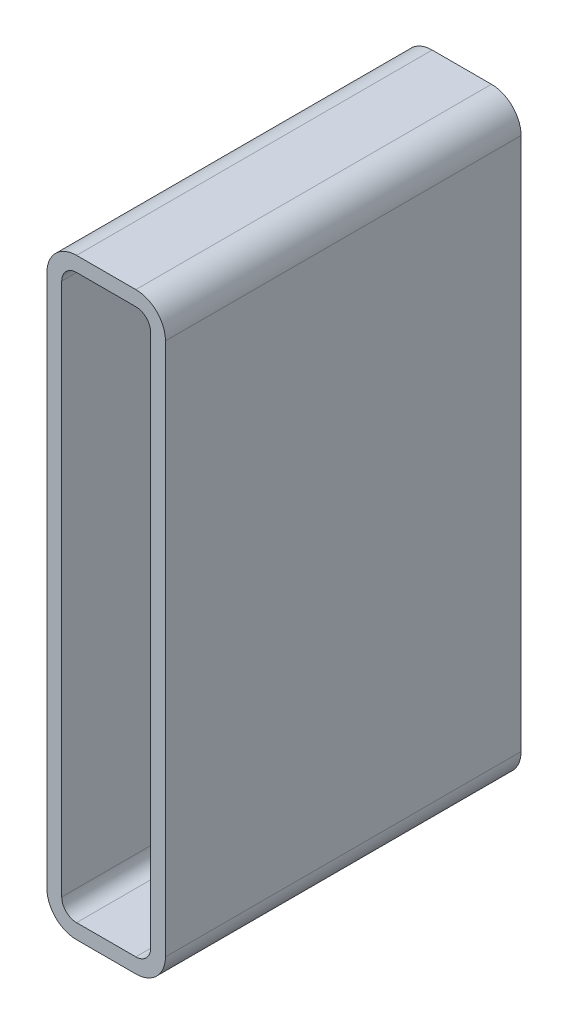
ISO-10303-21;
HEADER;
FILE_DESCRIPTION(('STEP AP214'),'2;1');
FILE_NAME('part.step','',(''),(''),'','','');
FILE_SCHEMA(('AUTOMOTIVE_DESIGN { 1 0 10303 214 1 1 1 1 }'));
ENDSEC;
DATA;
#1=APPLICATION_CONTEXT('core data for automotive mechanical design processes');
#2=APPLICATION_PROTOCOL_DEFINITION('international standard','automotive_design',2000,#1);
#3=PRODUCT_CONTEXT('',#1,'mechanical');
#4=PRODUCT('Part','Part','',(#3));
#5=PRODUCT_RELATED_PRODUCT_CATEGORY('part','',(#4));
#6=PRODUCT_DEFINITION_FORMATION('','',#4);
#7=PRODUCT_DEFINITION_CONTEXT('part definition',#1,'design');
#8=PRODUCT_DEFINITION('design','',#6,#7);
#9=PRODUCT_DEFINITION_SHAPE('','',#8);
#10=(LENGTH_UNIT() NAMED_UNIT(*) SI_UNIT(.MILLI.,.METRE.));
#11=(NAMED_UNIT(*) PLANE_ANGLE_UNIT() SI_UNIT($,.RADIAN.));
#12=(NAMED_UNIT(*) SI_UNIT($,.STERADIAN.) SOLID_ANGLE_UNIT());
#13=UNCERTAINTY_MEASURE_WITH_UNIT(LENGTH_MEASURE(1.E-05),#10,'distance_accuracy_value','');
#14=(GEOMETRIC_REPRESENTATION_CONTEXT(3) GLOBAL_UNCERTAINTY_ASSIGNED_CONTEXT((#13)) GLOBAL_UNIT_ASSIGNED_CONTEXT((#10,
#11,#12)) REPRESENTATION_CONTEXT('',''));
#15=CARTESIAN_POINT('',(0.,0.,0.));
#16=DIRECTION('',(0.,0.,1.));
#17=DIRECTION('',(1.,0.,0.));
#18=AXIS2_PLACEMENT_3D('',#15,#16,#17);
#19=CARTESIAN_POINT('',(77.8751778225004,27.0912282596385,304.8));
#20=DIRECTION('',(0.,0.,1.));
#21=DIRECTION('',(1.,0.,0.));
#22=AXIS2_PLACEMENT_3D('',#19,#20,#21);
#23=PLANE('',#22);
#24=CARTESIAN_POINT('',(77.8751778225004,27.0912282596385,304.8));
#25=DIRECTION('',(0.,0.,1.));
#26=DIRECTION('',(1.,0.,0.));
#27=AXIS2_PLACEMENT_3D('',#24,#25,#26);
#28=CIRCLE('',#27,25.4);
#29=CARTESIAN_POINT('',(77.8751778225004,1.6912282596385,304.8));
#30=VERTEX_POINT('',#29);
#31=CARTESIAN_POINT('',(103.2751778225,27.0912282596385,304.8));
#32=VERTEX_POINT('',#31);
#33=EDGE_CURVE('E211',#30,#32,#28,.T.);
#34=ORIENTED_EDGE('',*,*,#33,.T.);
#35=DIRECTION('',(0.,1.,0.));
#36=VECTOR('',#35,1.);
#37=CARTESIAN_POINT('',(103.2751778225,27.0912282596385,304.8));
#38=LINE('',#37,#36);
#39=CARTESIAN_POINT('',(103.2751778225,484.291228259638,304.8));
#40=VERTEX_POINT('',#39);
#41=EDGE_CURVE('E214',#32,#40,#38,.T.);
#42=ORIENTED_EDGE('',*,*,#41,.T.);
#43=CARTESIAN_POINT('',(77.8751778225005,484.291228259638,304.8));
#44=DIRECTION('',(0.,0.,1.));
#45=DIRECTION('',(1.,0.,0.));
#46=AXIS2_PLACEMENT_3D('',#43,#44,#45);
#47=CIRCLE('',#46,25.4);
#48=CARTESIAN_POINT('',(77.8751778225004,509.691228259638,304.8));
#49=VERTEX_POINT('',#48);
#50=EDGE_CURVE('E217',#40,#49,#47,.T.);
#51=ORIENTED_EDGE('',*,*,#50,.T.);
#52=DIRECTION('',(-1.,0.,0.));
#53=VECTOR('',#52,1.);
#54=CARTESIAN_POINT('',(77.8751778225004,509.691228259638,304.8));
#55=LINE('',#54,#53);
#56=CARTESIAN_POINT('',(27.0751778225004,509.691228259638,304.8));
#57=VERTEX_POINT('',#56);
#58=EDGE_CURVE('E219',#49,#57,#55,.T.);
#59=ORIENTED_EDGE('',*,*,#58,.T.);
#60=CARTESIAN_POINT('',(27.0751778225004,484.291228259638,304.8));
#61=DIRECTION('',(0.,0.,1.));
#62=DIRECTION('',(1.,0.,0.));
#63=AXIS2_PLACEMENT_3D('',#60,#61,#62);
#64=CIRCLE('',#63,25.4);
#65=CARTESIAN_POINT('',(1.67517782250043,484.291228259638,304.8));
#66=VERTEX_POINT('',#65);
#67=EDGE_CURVE('E221',#57,#66,#64,.T.);
#68=ORIENTED_EDGE('',*,*,#67,.T.);
#69=DIRECTION('',(0.,-1.,0.));
#70=VECTOR('',#69,1.);
#71=CARTESIAN_POINT('',(1.67517782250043,484.291228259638,304.8));
#72=LINE('',#71,#70);
#73=CARTESIAN_POINT('',(1.67517782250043,27.0912282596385,304.8));
#74=VERTEX_POINT('',#73);
#75=EDGE_CURVE('E223',#66,#74,#72,.T.);
#76=ORIENTED_EDGE('',*,*,#75,.T.);
#77=CARTESIAN_POINT('',(27.0751778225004,27.0912282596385,304.8));
#78=DIRECTION('',(0.,0.,1.));
#79=DIRECTION('',(1.,0.,0.));
#80=AXIS2_PLACEMENT_3D('',#77,#78,#79);
#81=CIRCLE('',#80,25.4);
#82=CARTESIAN_POINT('',(27.0751778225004,1.6912282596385,304.8));
#83=VERTEX_POINT('',#82);
#84=EDGE_CURVE('E225',#74,#83,#81,.T.);
#85=ORIENTED_EDGE('',*,*,#84,.T.);
#86=DIRECTION('',(1.,0.,0.));
#87=VECTOR('',#86,1.);
#88=CARTESIAN_POINT('',(27.0751778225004,1.6912282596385,304.8));
#89=LINE('',#88,#87);
#90=EDGE_CURVE('E227',#83,#30,#89,.T.);
#91=ORIENTED_EDGE('',*,*,#90,.T.);
#92=EDGE_LOOP('',(#34,#42,#51,#59,#68,#76,#85,#91));
#93=FACE_BOUND('',#92,.T.);
#94=DIRECTION('',(0.,-1.,0.));
#95=VECTOR('',#94,1.);
#96=CARTESIAN_POINT('',(14.3751778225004,27.0912282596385,304.8));
#97=LINE('',#96,#95);
#98=CARTESIAN_POINT('',(14.3751778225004,484.291228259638,304.8));
#99=VERTEX_POINT('',#98);
#100=CARTESIAN_POINT('',(14.3751778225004,27.0912282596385,304.8));
#101=VERTEX_POINT('',#100);
#102=EDGE_CURVE('E154',#99,#101,#97,.T.);
#103=ORIENTED_EDGE('',*,*,#102,.F.);
#104=CARTESIAN_POINT('',(27.0751778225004,484.291228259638,304.8));
#105=DIRECTION('',(0.,0.,1.));
#106=DIRECTION('',(1.,0.,0.));
#107=AXIS2_PLACEMENT_3D('',#104,#105,#106);
#108=CIRCLE('',#107,12.7);
#109=CARTESIAN_POINT('',(27.0751778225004,496.991228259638,304.8));
#110=VERTEX_POINT('',#109);
#111=EDGE_CURVE('E146',#110,#99,#108,.T.);
#112=ORIENTED_EDGE('',*,*,#111,.F.);
#113=DIRECTION('',(-1.,0.,0.));
#114=VECTOR('',#113,1.);
#115=CARTESIAN_POINT('',(27.0751778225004,496.991228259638,304.8));
#116=LINE('',#115,#114);
#117=CARTESIAN_POINT('',(77.8751778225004,496.991228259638,304.8));
#118=VERTEX_POINT('',#117);
#119=EDGE_CURVE('E179',#118,#110,#116,.T.);
#120=ORIENTED_EDGE('',*,*,#119,.F.);
#121=CARTESIAN_POINT('',(77.8751778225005,484.291228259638,304.8));
#122=DIRECTION('',(0.,0.,1.));
#123=DIRECTION('',(1.,0.,0.));
#124=AXIS2_PLACEMENT_3D('',#121,#122,#123);
#125=CIRCLE('',#124,12.7);
#126=CARTESIAN_POINT('',(90.5751778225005,484.291228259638,304.8));
#127=VERTEX_POINT('',#126);
#128=EDGE_CURVE('E177',#127,#118,#125,.T.);
#129=ORIENTED_EDGE('',*,*,#128,.F.);
#130=DIRECTION('',(0.,1.,0.));
#131=VECTOR('',#130,1.);
#132=CARTESIAN_POINT('',(90.5751778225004,484.291228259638,304.8));
#133=LINE('',#132,#131);
#134=CARTESIAN_POINT('',(90.5751778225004,27.0912282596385,304.8));
#135=VERTEX_POINT('',#134);
#136=EDGE_CURVE('E175',#135,#127,#133,.T.);
#137=ORIENTED_EDGE('',*,*,#136,.F.);
#138=CARTESIAN_POINT('',(77.8751778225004,27.0912282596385,304.8));
#139=DIRECTION('',(0.,0.,1.));
#140=DIRECTION('',(1.,0.,0.));
#141=AXIS2_PLACEMENT_3D('',#138,#139,#140);
#142=CIRCLE('',#141,12.7);
#143=CARTESIAN_POINT('',(77.8751778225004,14.3912282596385,304.8));
#144=VERTEX_POINT('',#143);
#145=EDGE_CURVE('E173',#144,#135,#142,.T.);
#146=ORIENTED_EDGE('',*,*,#145,.F.);
#147=DIRECTION('',(1.,0.,0.));
#148=VECTOR('',#147,1.);
#149=CARTESIAN_POINT('',(77.8751778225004,14.3912282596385,304.8));
#150=LINE('',#149,#148);
#151=CARTESIAN_POINT('',(27.0751778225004,14.3912282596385,304.8));
#152=VERTEX_POINT('',#151);
#153=EDGE_CURVE('E169',#152,#144,#150,.T.);
#154=ORIENTED_EDGE('',*,*,#153,.F.);
#155=CARTESIAN_POINT('',(27.0751778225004,27.0912282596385,304.8));
#156=DIRECTION('',(0.,0.,1.));
#157=DIRECTION('',(1.,0.,0.));
#158=AXIS2_PLACEMENT_3D('',#155,#156,#157);
#159=CIRCLE('',#158,12.7);
#160=EDGE_CURVE('E167',#101,#152,#159,.T.);
#161=ORIENTED_EDGE('',*,*,#160,.F.);
#162=EDGE_LOOP('',(#103,#112,#120,#129,#137,#146,#154,#161));
#163=FACE_BOUND('',#162,.T.);
#164=ADVANCED_FACE('F33',(#93,#163),#23,.T.);
#165=CARTESIAN_POINT('',(77.8751778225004,27.0912282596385,0.));
#166=DIRECTION('',(0.,0.,1.));
#167=DIRECTION('',(1.,0.,0.));
#168=AXIS2_PLACEMENT_3D('',#165,#166,#167);
#169=PLANE('',#168);
#170=CARTESIAN_POINT('',(77.8751778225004,27.0912282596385,0.));
#171=DIRECTION('',(0.,0.,1.));
#172=DIRECTION('',(1.,0.,0.));
#173=AXIS2_PLACEMENT_3D('',#170,#171,#172);
#174=CIRCLE('',#173,25.4);
#175=CARTESIAN_POINT('',(77.8751778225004,1.6912282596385,0.));
#176=VERTEX_POINT('',#175);
#177=CARTESIAN_POINT('',(103.2751778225,27.0912282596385,0.));
#178=VERTEX_POINT('',#177);
#179=EDGE_CURVE('E162',#176,#178,#174,.T.);
#180=ORIENTED_EDGE('',*,*,#179,.F.);
#181=DIRECTION('',(1.,0.,0.));
#182=VECTOR('',#181,1.);
#183=CARTESIAN_POINT('',(27.0751778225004,1.6912282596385,0.));
#184=LINE('',#183,#182);
#185=CARTESIAN_POINT('',(27.0751778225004,1.6912282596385,0.));
#186=VERTEX_POINT('',#185);
#187=EDGE_CURVE('E215',#186,#176,#184,.T.);
#188=ORIENTED_EDGE('',*,*,#187,.F.);
#189=CARTESIAN_POINT('',(27.0751778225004,27.0912282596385,0.));
#190=DIRECTION('',(0.,0.,1.));
#191=DIRECTION('',(1.,0.,0.));
#192=AXIS2_PLACEMENT_3D('',#189,#190,#191);
#193=CIRCLE('',#192,25.4);
#194=CARTESIAN_POINT('',(1.67517782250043,27.0912282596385,0.));
#195=VERTEX_POINT('',#194);
#196=EDGE_CURVE('E242',#195,#186,#193,.T.);
#197=ORIENTED_EDGE('',*,*,#196,.F.);
#198=DIRECTION('',(0.,-1.,0.));
#199=VECTOR('',#198,1.);
#200=CARTESIAN_POINT('',(1.67517782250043,484.291228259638,0.));
#201=LINE('',#200,#199);
#202=CARTESIAN_POINT('',(1.67517782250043,484.291228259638,0.));
#203=VERTEX_POINT('',#202);
#204=EDGE_CURVE('E240',#203,#195,#201,.T.);
#205=ORIENTED_EDGE('',*,*,#204,.F.);
#206=CARTESIAN_POINT('',(27.0751778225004,484.291228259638,0.));
#207=DIRECTION('',(0.,0.,1.));
#208=DIRECTION('',(1.,0.,0.));
#209=AXIS2_PLACEMENT_3D('',#206,#207,#208);
#210=CIRCLE('',#209,25.4);
#211=CARTESIAN_POINT('',(27.0751778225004,509.691228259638,0.));
#212=VERTEX_POINT('',#211);
#213=EDGE_CURVE('E238',#212,#203,#210,.T.);
#214=ORIENTED_EDGE('',*,*,#213,.F.);
#215=DIRECTION('',(-1.,0.,0.));
#216=VECTOR('',#215,1.);
#217=CARTESIAN_POINT('',(77.8751778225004,509.691228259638,0.));
#218=LINE('',#217,#216);
#219=CARTESIAN_POINT('',(77.8751778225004,509.691228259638,0.));
#220=VERTEX_POINT('',#219);
#221=EDGE_CURVE('E236',#220,#212,#218,.T.);
#222=ORIENTED_EDGE('',*,*,#221,.F.);
#223=CARTESIAN_POINT('',(77.8751778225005,484.291228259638,0.));
#224=DIRECTION('',(0.,0.,1.));
#225=DIRECTION('',(1.,0.,0.));
#226=AXIS2_PLACEMENT_3D('',#223,#224,#225);
#227=CIRCLE('',#226,25.4);
#228=CARTESIAN_POINT('',(103.2751778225,484.291228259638,0.));
#229=VERTEX_POINT('',#228);
#230=EDGE_CURVE('E234',#229,#220,#227,.T.);
#231=ORIENTED_EDGE('',*,*,#230,.F.);
#232=DIRECTION('',(0.,1.,0.));
#233=VECTOR('',#232,1.);
#234=CARTESIAN_POINT('',(103.2751778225,27.0912282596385,0.));
#235=LINE('',#234,#233);
#236=EDGE_CURVE('E232',#178,#229,#235,.T.);
#237=ORIENTED_EDGE('',*,*,#236,.F.);
#238=EDGE_LOOP('',(#180,#188,#197,#205,#214,#222,#231,#237));
#239=FACE_BOUND('',#238,.T.);
#240=CARTESIAN_POINT('',(27.0751778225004,484.291228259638,0.));
#241=DIRECTION('',(0.,0.,1.));
#242=DIRECTION('',(1.,0.,0.));
#243=AXIS2_PLACEMENT_3D('',#240,#241,#242);
#244=CIRCLE('',#243,12.7);
#245=CARTESIAN_POINT('',(27.0751778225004,496.991228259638,0.));
#246=VERTEX_POINT('',#245);
#247=CARTESIAN_POINT('',(14.3751778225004,484.291228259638,0.));
#248=VERTEX_POINT('',#247);
#249=EDGE_CURVE('E56',#246,#248,#244,.T.);
#250=ORIENTED_EDGE('',*,*,#249,.T.);
#251=DIRECTION('',(0.,-1.,0.));
#252=VECTOR('',#251,1.);
#253=CARTESIAN_POINT('',(14.3751778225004,27.0912282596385,0.));
#254=LINE('',#253,#252);
#255=CARTESIAN_POINT('',(14.3751778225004,27.0912282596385,0.));
#256=VERTEX_POINT('',#255);
#257=EDGE_CURVE('E161',#248,#256,#254,.T.);
#258=ORIENTED_EDGE('',*,*,#257,.T.);
#259=CARTESIAN_POINT('',(27.0751778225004,27.0912282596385,0.));
#260=DIRECTION('',(0.,0.,1.));
#261=DIRECTION('',(1.,0.,0.));
#262=AXIS2_PLACEMENT_3D('',#259,#260,#261);
#263=CIRCLE('',#262,12.7);
#264=CARTESIAN_POINT('',(27.0751778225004,14.3912282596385,0.));
#265=VERTEX_POINT('',#264);
#266=EDGE_CURVE('E183',#256,#265,#263,.T.);
#267=ORIENTED_EDGE('',*,*,#266,.T.);
#268=DIRECTION('',(1.,0.,0.));
#269=VECTOR('',#268,1.);
#270=CARTESIAN_POINT('',(77.8751778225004,14.3912282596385,0.));
#271=LINE('',#270,#269);
#272=CARTESIAN_POINT('',(77.8751778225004,14.3912282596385,0.));
#273=VERTEX_POINT('',#272);
#274=EDGE_CURVE('E186',#265,#273,#271,.T.);
#275=ORIENTED_EDGE('',*,*,#274,.T.);
#276=CARTESIAN_POINT('',(77.8751778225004,27.0912282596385,0.));
#277=DIRECTION('',(0.,0.,1.));
#278=DIRECTION('',(1.,0.,0.));
#279=AXIS2_PLACEMENT_3D('',#276,#277,#278);
#280=CIRCLE('',#279,12.7);
#281=CARTESIAN_POINT('',(90.5751778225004,27.0912282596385,0.));
#282=VERTEX_POINT('',#281);
#283=EDGE_CURVE('E189',#273,#282,#280,.T.);
#284=ORIENTED_EDGE('',*,*,#283,.T.);
#285=DIRECTION('',(0.,1.,0.));
#286=VECTOR('',#285,1.);
#287=CARTESIAN_POINT('',(90.5751778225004,484.291228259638,0.));
#288=LINE('',#287,#286);
#289=CARTESIAN_POINT('',(90.5751778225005,484.291228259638,0.));
#290=VERTEX_POINT('',#289);
#291=EDGE_CURVE('E192',#282,#290,#288,.T.);
#292=ORIENTED_EDGE('',*,*,#291,.T.);
#293=CARTESIAN_POINT('',(77.8751778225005,484.291228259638,0.));
#294=DIRECTION('',(0.,0.,1.));
#295=DIRECTION('',(1.,0.,0.));
#296=AXIS2_PLACEMENT_3D('',#293,#294,#295);
#297=CIRCLE('',#296,12.7);
#298=CARTESIAN_POINT('',(77.8751778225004,496.991228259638,0.));
#299=VERTEX_POINT('',#298);
#300=EDGE_CURVE('E195',#290,#299,#297,.T.);
#301=ORIENTED_EDGE('',*,*,#300,.T.);
#302=DIRECTION('',(-1.,0.,0.));
#303=VECTOR('',#302,1.);
#304=CARTESIAN_POINT('',(27.0751778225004,496.991228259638,0.));
#305=LINE('',#304,#303);
#306=EDGE_CURVE('E155',#299,#246,#305,.T.);
#307=ORIENTED_EDGE('',*,*,#306,.T.);
#308=EDGE_LOOP('',(#250,#258,#267,#275,#284,#292,#301,#307));
#309=FACE_BOUND('',#308,.T.);
#310=ADVANCED_FACE('F272',(#239,#309),#169,.F.);
#311=CARTESIAN_POINT('',(77.8751778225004,27.0912282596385,304.8));
#312=DIRECTION('',(0.,0.,-1.));
#313=DIRECTION('',(-1.,0.,0.));
#314=AXIS2_PLACEMENT_3D('',#311,#312,#313);
#315=CYLINDRICAL_SURFACE('',#314,25.4);
#316=ORIENTED_EDGE('',*,*,#179,.T.);
#317=DIRECTION('',(0.,0.,-1.));
#318=VECTOR('',#317,1.);
#319=CARTESIAN_POINT('',(103.2751778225,27.0912282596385,304.8));
#320=LINE('',#319,#318);
#321=EDGE_CURVE('E11',#32,#178,#320,.T.);
#322=ORIENTED_EDGE('',*,*,#321,.F.);
#323=ORIENTED_EDGE('',*,*,#33,.F.);
#324=DIRECTION('',(0.,0.,-1.));
#325=VECTOR('',#324,1.);
#326=CARTESIAN_POINT('',(77.8751778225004,1.6912282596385,304.8));
#327=LINE('',#326,#325);
#328=EDGE_CURVE('E229',#30,#176,#327,.T.);
#329=ORIENTED_EDGE('',*,*,#328,.T.);
#330=EDGE_LOOP('',(#316,#322,#323,#329));
#331=FACE_BOUND('',#330,.T.);
#332=ADVANCED_FACE('F35',(#331),#315,.T.);
#333=CARTESIAN_POINT('',(103.2751778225,27.0912282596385,304.8));
#334=DIRECTION('',(-1.,0.,0.));
#335=DIRECTION('',(0.,0.,1.));
#336=AXIS2_PLACEMENT_3D('',#333,#334,#335);
#337=PLANE('',#336);
#338=ORIENTED_EDGE('',*,*,#236,.T.);
#339=DIRECTION('',(0.,0.,-1.));
#340=VECTOR('',#339,1.);
#341=CARTESIAN_POINT('',(103.2751778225,484.291228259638,304.8));
#342=LINE('',#341,#340);
#343=EDGE_CURVE('E41',#40,#229,#342,.T.);
#344=ORIENTED_EDGE('',*,*,#343,.F.);
#345=ORIENTED_EDGE('',*,*,#41,.F.);
#346=ORIENTED_EDGE('',*,*,#321,.T.);
#347=EDGE_LOOP('',(#338,#344,#345,#346));
#348=FACE_BOUND('',#347,.T.);
#349=ADVANCED_FACE('F289',(#348),#337,.F.);
#350=CARTESIAN_POINT('',(77.8751778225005,484.291228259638,304.8));
#351=DIRECTION('',(0.,0.,-1.));
#352=DIRECTION('',(-1.,0.,0.));
#353=AXIS2_PLACEMENT_3D('',#350,#351,#352);
#354=CYLINDRICAL_SURFACE('',#353,25.4);
#355=ORIENTED_EDGE('',*,*,#230,.T.);
#356=DIRECTION('',(0.,0.,-1.));
#357=VECTOR('',#356,1.);
#358=CARTESIAN_POINT('',(77.8751778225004,509.691228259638,304.8));
#359=LINE('',#358,#357);
#360=EDGE_CURVE('E259',#49,#220,#359,.T.);
#361=ORIENTED_EDGE('',*,*,#360,.F.);
#362=ORIENTED_EDGE('',*,*,#50,.F.);
#363=ORIENTED_EDGE('',*,*,#343,.T.);
#364=EDGE_LOOP('',(#355,#361,#362,#363));
#365=FACE_BOUND('',#364,.T.);
#366=ADVANCED_FACE('F266',(#365),#354,.T.);
#367=CARTESIAN_POINT('',(77.8751778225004,509.691228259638,304.8));
#368=DIRECTION('',(0.,-1.,0.));
#369=DIRECTION('',(0.,0.,-1.));
#370=AXIS2_PLACEMENT_3D('',#367,#368,#369);
#371=PLANE('',#370);
#372=ORIENTED_EDGE('',*,*,#221,.T.);
#373=DIRECTION('',(0.,0.,-1.));
#374=VECTOR('',#373,1.);
#375=CARTESIAN_POINT('',(27.0751778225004,509.691228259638,304.8));
#376=LINE('',#375,#374);
#377=EDGE_CURVE('E256',#57,#212,#376,.T.);
#378=ORIENTED_EDGE('',*,*,#377,.F.);
#379=ORIENTED_EDGE('',*,*,#58,.F.);
#380=ORIENTED_EDGE('',*,*,#360,.T.);
#381=EDGE_LOOP('',(#372,#378,#379,#380));
#382=FACE_BOUND('',#381,.T.);
#383=ADVANCED_FACE('F278',(#382),#371,.F.);
#384=CARTESIAN_POINT('',(27.0751778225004,484.291228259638,304.8));
#385=DIRECTION('',(0.,0.,-1.));
#386=DIRECTION('',(-1.,0.,0.));
#387=AXIS2_PLACEMENT_3D('',#384,#385,#386);
#388=CYLINDRICAL_SURFACE('',#387,25.4);
#389=ORIENTED_EDGE('',*,*,#213,.T.);
#390=DIRECTION('',(0.,0.,-1.));
#391=VECTOR('',#390,1.);
#392=CARTESIAN_POINT('',(1.67517782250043,484.291228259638,304.8));
#393=LINE('',#392,#391);
#394=EDGE_CURVE('E253',#66,#203,#393,.T.);
#395=ORIENTED_EDGE('',*,*,#394,.F.);
#396=ORIENTED_EDGE('',*,*,#67,.F.);
#397=ORIENTED_EDGE('',*,*,#377,.T.);
#398=EDGE_LOOP('',(#389,#395,#396,#397));
#399=FACE_BOUND('',#398,.T.);
#400=ADVANCED_FACE('F282',(#399),#388,.T.);
#401=CARTESIAN_POINT('',(1.67517782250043,484.291228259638,304.8));
#402=DIRECTION('',(1.,0.,0.));
#403=DIRECTION('',(0.,0.,-1.));
#404=AXIS2_PLACEMENT_3D('',#401,#402,#403);
#405=PLANE('',#404);
#406=ORIENTED_EDGE('',*,*,#204,.T.);
#407=DIRECTION('',(0.,0.,-1.));
#408=VECTOR('',#407,1.);
#409=CARTESIAN_POINT('',(1.67517782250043,27.0912282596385,304.8));
#410=LINE('',#409,#408);
#411=EDGE_CURVE('E250',#74,#195,#410,.T.);
#412=ORIENTED_EDGE('',*,*,#411,.F.);
#413=ORIENTED_EDGE('',*,*,#75,.F.);
#414=ORIENTED_EDGE('',*,*,#394,.T.);
#415=EDGE_LOOP('',(#406,#412,#413,#414));
#416=FACE_BOUND('',#415,.T.);
#417=ADVANCED_FACE('F302',(#416),#405,.F.);
#418=CARTESIAN_POINT('',(27.0751778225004,27.0912282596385,304.8));
#419=DIRECTION('',(0.,0.,-1.));
#420=DIRECTION('',(-1.,0.,0.));
#421=AXIS2_PLACEMENT_3D('',#418,#419,#420);
#422=CYLINDRICAL_SURFACE('',#421,25.4);
#423=ORIENTED_EDGE('',*,*,#196,.T.);
#424=DIRECTION('',(0.,0.,-1.));
#425=VECTOR('',#424,1.);
#426=CARTESIAN_POINT('',(27.0751778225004,1.6912282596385,304.8));
#427=LINE('',#426,#425);
#428=EDGE_CURVE('E247',#83,#186,#427,.T.);
#429=ORIENTED_EDGE('',*,*,#428,.F.);
#430=ORIENTED_EDGE('',*,*,#84,.F.);
#431=ORIENTED_EDGE('',*,*,#411,.T.);
#432=EDGE_LOOP('',(#423,#429,#430,#431));
#433=FACE_BOUND('',#432,.T.);
#434=ADVANCED_FACE('F300',(#433),#422,.T.);
#435=CARTESIAN_POINT('',(27.0751778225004,1.6912282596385,304.8));
#436=DIRECTION('',(0.,1.,0.));
#437=DIRECTION('',(0.,0.,1.));
#438=AXIS2_PLACEMENT_3D('',#435,#436,#437);
#439=PLANE('',#438);
#440=ORIENTED_EDGE('',*,*,#187,.T.);
#441=ORIENTED_EDGE('',*,*,#328,.F.);
#442=ORIENTED_EDGE('',*,*,#90,.F.);
#443=ORIENTED_EDGE('',*,*,#428,.T.);
#444=EDGE_LOOP('',(#440,#441,#442,#443));
#445=FACE_BOUND('',#444,.T.);
#446=ADVANCED_FACE('F295',(#445),#439,.F.);
#447=CARTESIAN_POINT('',(27.0751778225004,484.291228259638,304.8));
#448=DIRECTION('',(0.,0.,-1.));
#449=DIRECTION('',(-1.,0.,0.));
#450=AXIS2_PLACEMENT_3D('',#447,#448,#449);
#451=CYLINDRICAL_SURFACE('',#450,12.7);
#452=ORIENTED_EDGE('',*,*,#249,.F.);
#453=DIRECTION('',(0.,0.,-1.));
#454=VECTOR('',#453,1.);
#455=CARTESIAN_POINT('',(27.0751778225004,496.991228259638,304.8));
#456=LINE('',#455,#454);
#457=EDGE_CURVE('E150',#110,#246,#456,.T.);
#458=ORIENTED_EDGE('',*,*,#457,.F.);
#459=ORIENTED_EDGE('',*,*,#111,.T.);
#460=DIRECTION('',(0.,0.,-1.));
#461=VECTOR('',#460,1.);
#462=CARTESIAN_POINT('',(14.3751778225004,484.291228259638,304.8));
#463=LINE('',#462,#461);
#464=EDGE_CURVE('E149',#99,#248,#463,.T.);
#465=ORIENTED_EDGE('',*,*,#464,.T.);
#466=EDGE_LOOP('',(#452,#458,#459,#465));
#467=FACE_BOUND('',#466,.T.);
#468=ADVANCED_FACE('F148',(#467),#451,.F.);
#469=CARTESIAN_POINT('',(14.3751778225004,27.0912282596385,304.8));
#470=DIRECTION('',(1.,0.,0.));
#471=DIRECTION('',(0.,0.,-1.));
#472=AXIS2_PLACEMENT_3D('',#469,#470,#471);
#473=PLANE('',#472);
#474=ORIENTED_EDGE('',*,*,#257,.F.);
#475=ORIENTED_EDGE('',*,*,#464,.F.);
#476=ORIENTED_EDGE('',*,*,#102,.T.);
#477=DIRECTION('',(0.,0.,-1.));
#478=VECTOR('',#477,1.);
#479=CARTESIAN_POINT('',(14.3751778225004,27.0912282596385,304.8));
#480=LINE('',#479,#478);
#481=EDGE_CURVE('E163',#101,#256,#480,.T.);
#482=ORIENTED_EDGE('',*,*,#481,.T.);
#483=EDGE_LOOP('',(#474,#475,#476,#482));
#484=FACE_BOUND('',#483,.T.);
#485=ADVANCED_FACE('F158',(#484),#473,.T.);
#486=CARTESIAN_POINT('',(27.0751778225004,27.0912282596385,304.8));
#487=DIRECTION('',(0.,0.,-1.));
#488=DIRECTION('',(-1.,0.,0.));
#489=AXIS2_PLACEMENT_3D('',#486,#487,#488);
#490=CYLINDRICAL_SURFACE('',#489,12.7);
#491=ORIENTED_EDGE('',*,*,#266,.F.);
#492=ORIENTED_EDGE('',*,*,#481,.F.);
#493=ORIENTED_EDGE('',*,*,#160,.T.);
#494=DIRECTION('',(0.,0.,-1.));
#495=VECTOR('',#494,1.);
#496=CARTESIAN_POINT('',(27.0751778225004,14.3912282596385,304.8));
#497=LINE('',#496,#495);
#498=EDGE_CURVE('E208',#152,#265,#497,.T.);
#499=ORIENTED_EDGE('',*,*,#498,.T.);
#500=EDGE_LOOP('',(#491,#492,#493,#499));
#501=FACE_BOUND('',#500,.T.);
#502=ADVANCED_FACE('F327',(#501),#490,.F.);
#503=CARTESIAN_POINT('',(77.8751778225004,14.3912282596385,304.8));
#504=DIRECTION('',(0.,1.,0.));
#505=DIRECTION('',(0.,0.,1.));
#506=AXIS2_PLACEMENT_3D('',#503,#504,#505);
#507=PLANE('',#506);
#508=ORIENTED_EDGE('',*,*,#274,.F.);
#509=ORIENTED_EDGE('',*,*,#498,.F.);
#510=ORIENTED_EDGE('',*,*,#153,.T.);
#511=DIRECTION('',(0.,0.,-1.));
#512=VECTOR('',#511,1.);
#513=CARTESIAN_POINT('',(77.8751778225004,14.3912282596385,304.8));
#514=LINE('',#513,#512);
#515=EDGE_CURVE('E206',#144,#273,#514,.T.);
#516=ORIENTED_EDGE('',*,*,#515,.T.);
#517=EDGE_LOOP('',(#508,#509,#510,#516));
#518=FACE_BOUND('',#517,.T.);
#519=ADVANCED_FACE('F331',(#518),#507,.T.);
#520=CARTESIAN_POINT('',(77.8751778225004,27.0912282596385,304.8));
#521=DIRECTION('',(0.,0.,-1.));
#522=DIRECTION('',(-1.,0.,0.));
#523=AXIS2_PLACEMENT_3D('',#520,#521,#522);
#524=CYLINDRICAL_SURFACE('',#523,12.7);
#525=ORIENTED_EDGE('',*,*,#283,.F.);
#526=ORIENTED_EDGE('',*,*,#515,.F.);
#527=ORIENTED_EDGE('',*,*,#145,.T.);
#528=DIRECTION('',(0.,0.,-1.));
#529=VECTOR('',#528,1.);
#530=CARTESIAN_POINT('',(90.5751778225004,27.0912282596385,304.8));
#531=LINE('',#530,#529);
#532=EDGE_CURVE('E204',#135,#282,#531,.T.);
#533=ORIENTED_EDGE('',*,*,#532,.T.);
#534=EDGE_LOOP('',(#525,#526,#527,#533));
#535=FACE_BOUND('',#534,.T.);
#536=ADVANCED_FACE('F337',(#535),#524,.F.);
#537=CARTESIAN_POINT('',(90.5751778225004,484.291228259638,304.8));
#538=DIRECTION('',(-1.,0.,0.));
#539=DIRECTION('',(0.,0.,1.));
#540=AXIS2_PLACEMENT_3D('',#537,#538,#539);
#541=PLANE('',#540);
#542=ORIENTED_EDGE('',*,*,#291,.F.);
#543=ORIENTED_EDGE('',*,*,#532,.F.);
#544=ORIENTED_EDGE('',*,*,#136,.T.);
#545=DIRECTION('',(0.,0.,-1.));
#546=VECTOR('',#545,1.);
#547=CARTESIAN_POINT('',(90.5751778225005,484.291228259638,304.8));
#548=LINE('',#547,#546);
#549=EDGE_CURVE('E202',#127,#290,#548,.T.);
#550=ORIENTED_EDGE('',*,*,#549,.T.);
#551=EDGE_LOOP('',(#542,#543,#544,#550));
#552=FACE_BOUND('',#551,.T.);
#553=ADVANCED_FACE('F341',(#552),#541,.T.);
#554=CARTESIAN_POINT('',(77.8751778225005,484.291228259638,304.8));
#555=DIRECTION('',(0.,0.,-1.));
#556=DIRECTION('',(-1.,0.,0.));
#557=AXIS2_PLACEMENT_3D('',#554,#555,#556);
#558=CYLINDRICAL_SURFACE('',#557,12.7);
#559=ORIENTED_EDGE('',*,*,#300,.F.);
#560=ORIENTED_EDGE('',*,*,#549,.F.);
#561=ORIENTED_EDGE('',*,*,#128,.T.);
#562=DIRECTION('',(0.,0.,-1.));
#563=VECTOR('',#562,1.);
#564=CARTESIAN_POINT('',(77.8751778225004,496.991228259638,304.8));
#565=LINE('',#564,#563);
#566=EDGE_CURVE('E48',#118,#299,#565,.T.);
#567=ORIENTED_EDGE('',*,*,#566,.T.);
#568=EDGE_LOOP('',(#559,#560,#561,#567));
#569=FACE_BOUND('',#568,.T.);
#570=ADVANCED_FACE('F345',(#569),#558,.F.);
#571=CARTESIAN_POINT('',(27.0751778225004,496.991228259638,304.8));
#572=DIRECTION('',(0.,-1.,0.));
#573=DIRECTION('',(0.,0.,-1.));
#574=AXIS2_PLACEMENT_3D('',#571,#572,#573);
#575=PLANE('',#574);
#576=ORIENTED_EDGE('',*,*,#306,.F.);
#577=ORIENTED_EDGE('',*,*,#566,.F.);
#578=ORIENTED_EDGE('',*,*,#119,.T.);
#579=ORIENTED_EDGE('',*,*,#457,.T.);
#580=EDGE_LOOP('',(#576,#577,#578,#579));
#581=FACE_BOUND('',#580,.T.);
#582=ADVANCED_FACE('F349',(#581),#575,.T.);
#583=CLOSED_SHELL('',(#164,#310,#332,#349,#366,#383,#400,#417,#434,#446,#468,#485,#502,#519,
#536,#553,#570,#582));
#584=MANIFOLD_SOLID_BREP('B2',#583);
#585=ADVANCED_BREP_SHAPE_REPRESENTATION('',(#18,#584),#14);
#586=SHAPE_DEFINITION_REPRESENTATION(#9,#585);
ENDSEC;
END-ISO-10303-21;
